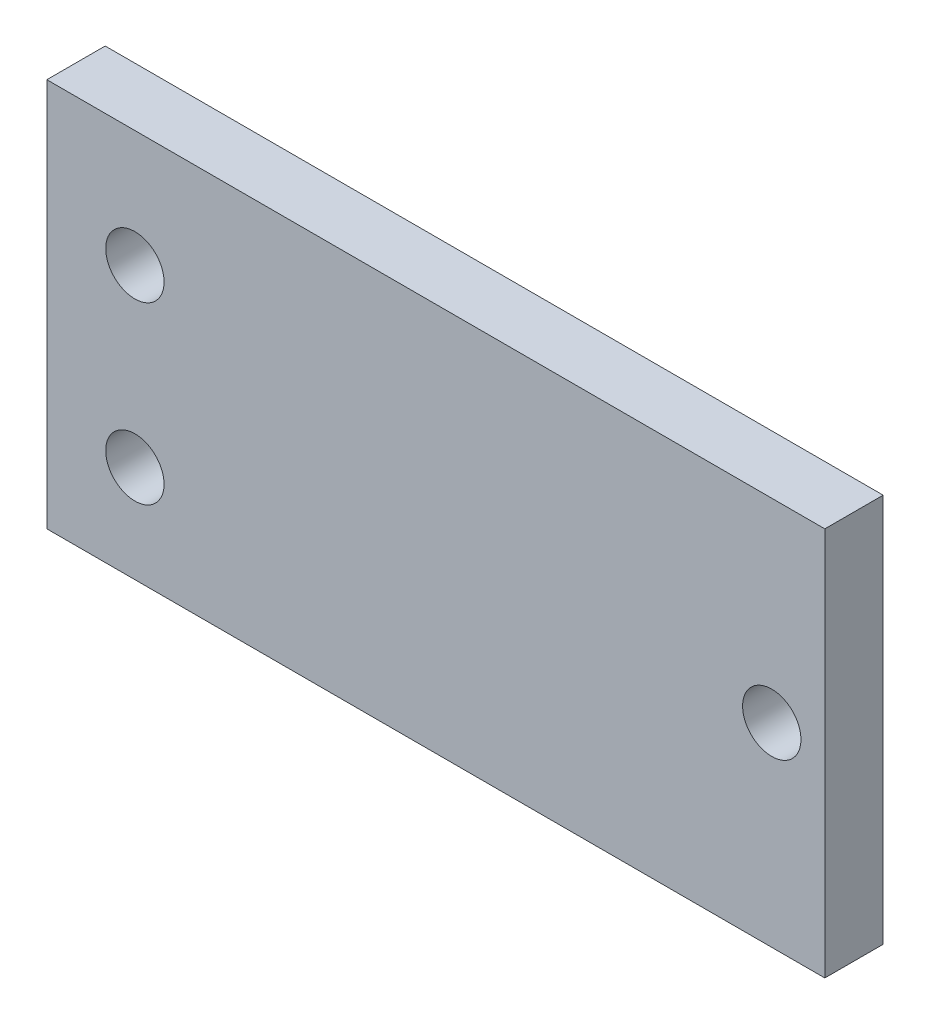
from build123d import *

# Parameters (mm, degrees)
SKETCH1_W           = 40
SKETCH1_H           = 20
SKETCH1_R           = 1.5
BOSS_EXTRUDE1_DEPTH = 3


with BuildPart() as part:
    # Sketch1 → Boss-Extrude1 (new body)
    with BuildSketch(Plane.XY):
        with Locations((20, -10)):
            Rectangle(SKETCH1_W, SKETCH1_H)
        with Locations((37.272505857, -10)):
            Circle(SKETCH1_R, mode=Mode.SUBTRACT)
        with Locations((4.52685422, -6)):
            Circle(SKETCH1_R, mode=Mode.SUBTRACT)
        with Locations((4.52685422, -15)):
            Circle(SKETCH1_R, mode=Mode.SUBTRACT)
    extrude(amount=BOSS_EXTRUDE1_DEPTH)


solid = part.part
